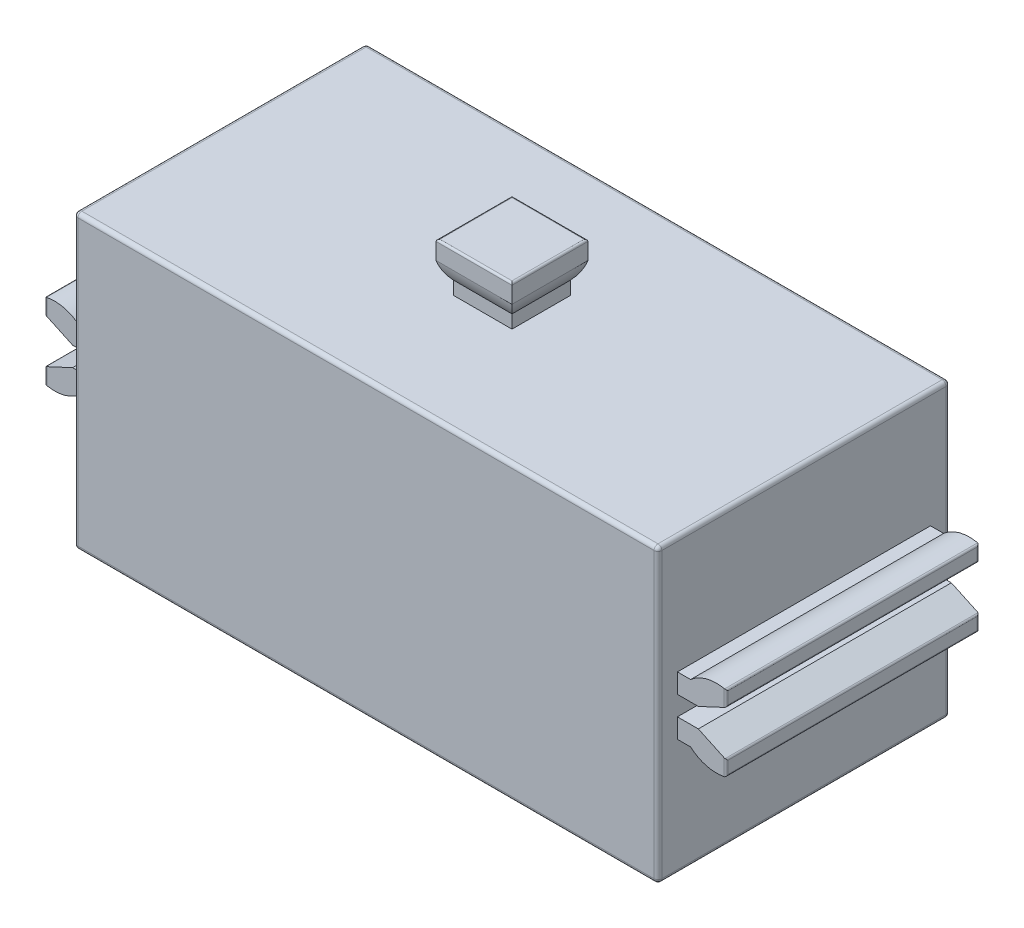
from build123d import *

# Parameters (mm, degrees)
EXTRUDE_1_DEPTH      = 7.5
EXTRUDE_1_DEPTH_BACK = 7.5
SKETCH_1_W           = 30
SKETCH_1_H           = 15
EXTRUDE_START        = -1
EXTRUDE_2_DEPTH      = 13
SKETCH_3_W           = 3
SKETCH_3_H           = 3
EXTRUDE_3_DEPTH      = 1
EXTRUDE_4_DEPTH      = 2
EXTRUDE_4_DEPTH_BACK = 3
CUT_EXTRUDE_1_REACH  = 25.12
SKETCH_6_R           = 2.25
CUT_EXTRUDE_2_DEPTH  = 2
SKETCH_10_W          = 3.5
SKETCH_10_H          = 3.793222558
CUT_EXTRUDE_3_DEPTH  = 1
FILLET_1_R           = 0.1
FILLET_2_R           = 0.2


with BuildPart() as part:
    # Sketch 1 → Extrude 1 (new, two sides: drawn at the far end of the back side and taken through both)
    with BuildSketch(Plane.XY.offset(-EXTRUDE_1_DEPTH_BACK)):
        Rectangle(SKETCH_1_W, SKETCH_1_H)
    extrude(amount=EXTRUDE_1_DEPTH + EXTRUDE_1_DEPTH_BACK)

    # Sketch 2 → Extrude 2 (add)
    with BuildSketch(Plane.XY.offset(7.5).offset(EXTRUDE_START)):
        with BuildLine():
            Line((-15.677124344, 1.5), (-15, 1.5))
            Line((-15, 1.5), (-15, 0.5))
            Line((-15, 0.5), (-16.07225346, 0.5))
            Line((-16.07225346, 0.5), (-17.5, 1.165769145))
            Line((-17.5, 1.165769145), (-17.5, 1.936491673))
            ThreePointArc((-17.5, 1.936491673), (-16.53426152, 1.94501611), (-15.677124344, 1.5))
        make_face()
        with BuildLine():
            Line((-15.677124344, -1.5), (-15, -1.5))
            Line((-15, -1.5), (-15, -0.5))
            Line((-15, -0.5), (-16.07225346, -0.5))
            Line((-16.07225346, -0.5), (-17.5, -1.165769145))
            Line((-17.5, -1.165769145), (-17.5, -1.936491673))
            ThreePointArc((-17.5, -1.936491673), (-16.53426152, -1.94501611), (-15.677124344, -1.5))
        make_face()
        with BuildLine():
            Line((15, -0.5), (15, -1.5))
            Line((15, -1.5), (15.677124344, -1.5))
            ThreePointArc((15.677124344, -1.5), (16.53426152, -1.94501611), (17.5, -1.936491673))
            Line((17.5, -1.936491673), (17.5, -1.165769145))
            Line((17.5, -1.165769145), (16.07225346, -0.5))
            Line((16.07225346, -0.5), (15, -0.5))
        make_face()
        with BuildLine():
            Line((15, 0.5), (16.07225346, 0.5))
            Line((16.07225346, 0.5), (17.5, 1.165769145))
            Line((17.5, 1.165769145), (17.5, 1.936491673))
            ThreePointArc((17.5, 1.936491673), (16.53426152, 1.94501611), (15.677124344, 1.5))
            Line((15.677124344, 1.5), (15, 1.5))
            Line((15, 1.5), (15, 0.5))
        make_face()
    extrude(amount=-EXTRUDE_2_DEPTH)

    # Sketch 3 → Extrude 3 (add)
    with BuildSketch(Plane(origin=(0, 7.5, 0), x_dir=(-1, 0, 0), z_dir=(0, 1, 0))):
        Rectangle(SKETCH_3_W, SKETCH_3_H)
    extrude(amount=EXTRUDE_3_DEPTH)

    # Sketch 4 → Extrude 4 (add, two sides: drawn at the far end of the back side and taken through both)
    with BuildSketch(Plane.XY.offset(-EXTRUDE_4_DEPTH_BACK)):
        with BuildLine():
            Line((-1.95, 10), (1.95, 10))
            Line((1.95, 10), (1.95, 9.055590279))
            ThreePointArc((1.95, 9.055590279), (1.780042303, 8.588161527), (1.5, 8.177124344))
            Line((1.5, 8.177124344), (-1.5, 8.177124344))
            ThreePointArc((-1.5, 8.177124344), (-1.780042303, 8.588161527), (-1.95, 9.055590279))
            Line((-1.95, 9.055590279), (-1.95, 10))
        make_face()
    extrude(amount=EXTRUDE_4_DEPTH + EXTRUDE_4_DEPTH_BACK)

    # Sketch 5 → Cut-Extrude 1 (cut, up to next)
    with BuildSketch(Plane(origin=(1.95, 0, 0), x_dir=(0, 0, -1), z_dir=(1, 0, 0)), mode=Mode.PRIVATE) as cut_extrude_1_sk1:
        with BuildLine():
            Line((-1.95, 10), (-1.95, 9.055590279))
            ThreePointArc((-1.95, 9.055590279), (-1.780042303, 8.588161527), (-1.5, 8.177124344))
            Line((-1.5, 8.177124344), (-2, 8.177124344))
            Line((-2, 8.177124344), (-2, 10))
            Line((-2, 10), (-1.95, 10))
        make_face()
    cut_extrude_1_tool1 = extrude(cut_extrude_1_sk1.sketch, amount=-CUT_EXTRUDE_1_REACH, mode=Mode.PRIVATE) & part.part
    # Sketch 5 → Cut-Extrude 1 (cut, up to next)
    with BuildSketch(Plane(origin=(1.95, 0, 0), x_dir=(0, 0, -1), z_dir=(1, 0, 0)), mode=Mode.PRIVATE) as cut_extrude_1_sk2:
        with BuildLine():
            Line((3, 10), (3, 8.177124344))
            Line((3, 8.177124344), (1.5, 8.177124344))
            ThreePointArc((1.5, 8.177124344), (1.780042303, 8.588161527), (1.95, 9.055590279))
            Line((1.95, 9.055590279), (1.95, 10))
            Line((1.95, 10), (3, 10))
        make_face()
    cut_extrude_1_tool2 = extrude(cut_extrude_1_sk2.sketch, amount=-CUT_EXTRUDE_1_REACH, mode=Mode.PRIVATE) & part.part
    add(cut_extrude_1_tool1.solids().sort_by_distance((1.95, 8.675075, 1.873038))[0], mode=Mode.SUBTRACT)
    add(cut_extrude_1_tool2.solids().sort_by_distance((1.95, 9.039049, -2.424924))[0], mode=Mode.SUBTRACT)

    # Sketch 6 → Cut-Extrude 2 (cut)
    with BuildSketch(Plane.XZ.offset(7.5)):
        with Locations(Location((-5, 4, 0), (0, 0, 270))):
            Circle(SKETCH_6_R)
        with Locations(Location((5, 4, 0), (0, 0, 270))):
            Circle(SKETCH_6_R)
    extrude(amount=-CUT_EXTRUDE_2_DEPTH, mode=Mode.SUBTRACT)

    # Sketch 10 → Cut-Extrude 3 (cut)
    with BuildSketch(Plane.XZ.offset(7.5)):
        with Locations((-5, -3.896611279)):
            Rectangle(SKETCH_10_W, SKETCH_10_H)
        with Locations((5, -3.896611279)):
            Rectangle(SKETCH_10_W, SKETCH_10_H)
    extrude(amount=-CUT_EXTRUDE_3_DEPTH, mode=Mode.SUBTRACT)

    # Sketch 11 → Revolve 3 (revolve)
    with BuildSketch(Plane.XZ.offset(6.5)):
        with BuildLine():
            Line((-5, -3.25), (-5, -4.75))
            ThreePointArc((-5, -4.75), (-4.25, -4), (-5, -3.25))
        make_face()
    revolve(axis=Axis((-5, -6.5, -3.25), (0, 0, -1)))

    # Sketch 12 → Revolve 4 (revolve)
    with BuildSketch(Plane.XZ.offset(6.5)):
        with BuildLine():
            Line((5, -3.25), (5, -4.75))
            ThreePointArc((5, -4.75), (5.75, -4), (5, -3.25))
        make_face()
    revolve(axis=Axis((5, -6.5, -3.25), (0, 0, -1)))

    # Fillet 1
    fillet_1_edges = [part.edges().sort_by_distance(p)[0] for p in [
        (0, 10, 1.95),
        (1.95, 10, 0),
        (-1.95, 10, 0),
        (0, 10, -1.95),
        (-17.5, -1.551130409, -6.5),
        (-17.5, -1.936491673, 0),
        (-17.5, -1.165769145, 0),
        (-17.5, -1.551130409, 6.5),
        (-17.5, 1.551130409, -6.5),
        (-17.5, 1.165769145, 0),
        (-17.5, 1.936491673, 0),
        (-17.5, 1.551130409, 6.5),
        (17.5, -1.936491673, 0),
        (17.5, -1.551130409, -6.5),
        (17.5, -1.165769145, 0),
        (17.5, -1.551130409, 6.5),
        (17.5, 1.551130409, -6.5),
        (17.5, 1.936491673, 0),
        (17.5, 1.165769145, 0),
        (17.5, 1.551130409, 6.5),
    ]]
    fillet(fillet_1_edges, radius=FILLET_1_R)

    # Fillet 2
    fillet_2_edges = [part.edges().sort_by_distance(p)[0] for p in [
        (15, 0, -7.5),
        (-15, 0, 7.5),
        (0, -7.5, 7.5),
        (0, 7.5, -7.5),
        (15, 0, 7.5),
        (0, 7.5, 7.5),
        (-15, 0, -7.5),
        (0, -7.5, -7.5),
        (-15, 7.5, 0),
        (15, 7.5, 0),
        (15, -7.5, 0),
        (-15, -7.5, 0),
    ]]
    fillet(fillet_2_edges, radius=FILLET_2_R)


with BuildPart() as body_2:
    # Sketch 7 → Revolve 1 (revolve)
    with BuildSketch(Plane.XZ.offset(7.5)):
        with BuildLine():
            Line((-5, 6), (-5, 2))
            ThreePointArc((-5, 2), (-3, 4), (-5, 6))
        make_face()
    revolve(axis=Axis((-5, -7.5, 6), (0, 0, -1)))


with BuildPart() as body_3:
    # Sketch 8 → Revolve 2 (revolve)
    with BuildSketch(Plane.XZ.offset(7.5)):
        with BuildLine():
            Line((5, 6), (5, 2))
            ThreePointArc((5, 2), (7, 4), (5, 6))
        make_face()
    revolve(axis=Axis((5, -7.5, 6), (0, 0, -1)))


solid = Compound([part.part, body_2.part, body_3.part])
